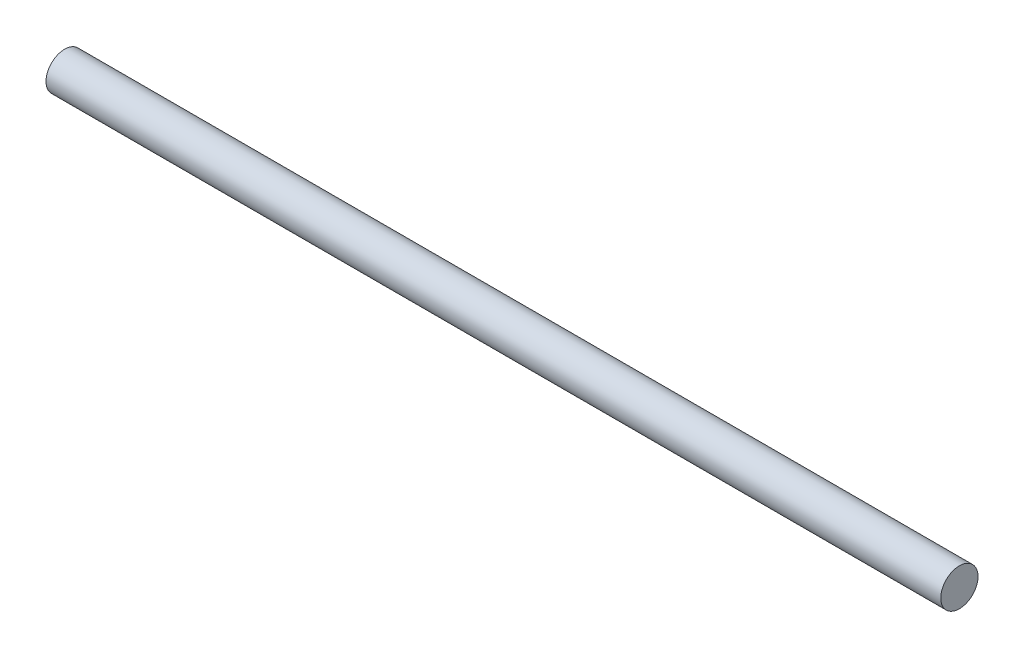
from build123d import *

# Parameters (mm, degrees)
SKETCH1_R           = 6.35
BOSS_EXTRUDE1_DEPTH = 304.8


with BuildPart() as part:
    # Sketch1 → Boss-Extrude1 (new body)
    with BuildSketch(Plane(origin=(0, 0, 0), x_dir=(0, 0, -1), z_dir=(1, 0, 0))):
        with Locations(Location((0, 0, 0), (0, 0, 180))):
            Circle(SKETCH1_R)
    extrude(amount=BOSS_EXTRUDE1_DEPTH)


solid = part.part
